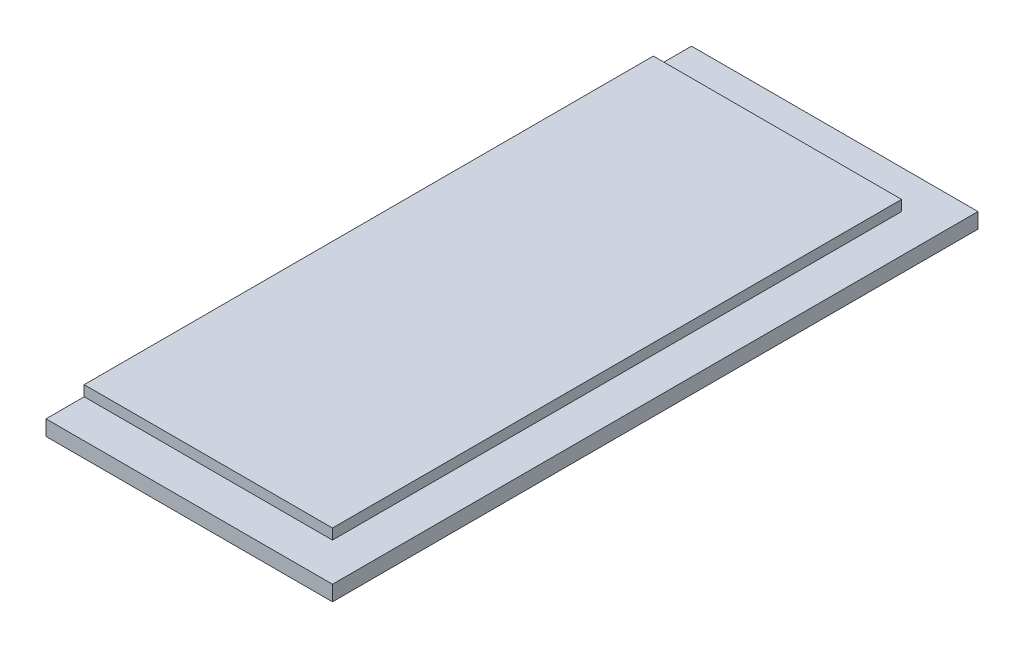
ISO-10303-21;
HEADER;
FILE_DESCRIPTION(('STEP AP214'),'2;1');
FILE_NAME('part.step','',(''),(''),'','','');
FILE_SCHEMA(('AUTOMOTIVE_DESIGN { 1 0 10303 214 1 1 1 1 }'));
ENDSEC;
DATA;
#1=APPLICATION_CONTEXT('core data for automotive mechanical design processes');
#2=APPLICATION_PROTOCOL_DEFINITION('international standard','automotive_design',2000,#1);
#3=PRODUCT_CONTEXT('',#1,'mechanical');
#4=PRODUCT('Part','Part','',(#3));
#5=PRODUCT_RELATED_PRODUCT_CATEGORY('part','',(#4));
#6=PRODUCT_DEFINITION_FORMATION('','',#4);
#7=PRODUCT_DEFINITION_CONTEXT('part definition',#1,'design');
#8=PRODUCT_DEFINITION('design','',#6,#7);
#9=PRODUCT_DEFINITION_SHAPE('','',#8);
#10=(LENGTH_UNIT() NAMED_UNIT(*) SI_UNIT(.MILLI.,.METRE.));
#11=(NAMED_UNIT(*) PLANE_ANGLE_UNIT() SI_UNIT($,.RADIAN.));
#12=(NAMED_UNIT(*) SI_UNIT($,.STERADIAN.) SOLID_ANGLE_UNIT());
#13=UNCERTAINTY_MEASURE_WITH_UNIT(LENGTH_MEASURE(1.E-05),#10,'distance_accuracy_value','');
#14=(GEOMETRIC_REPRESENTATION_CONTEXT(3) GLOBAL_UNCERTAINTY_ASSIGNED_CONTEXT((#13)) GLOBAL_UNIT_ASSIGNED_CONTEXT((#10,
#11,#12)) REPRESENTATION_CONTEXT('',''));
#15=CARTESIAN_POINT('',(0.,0.,0.));
#16=DIRECTION('',(0.,0.,1.));
#17=DIRECTION('',(1.,0.,0.));
#18=AXIS2_PLACEMENT_3D('',#15,#16,#17);
#19=CARTESIAN_POINT('',(15.,3.8,33.8));
#20=DIRECTION('',(-1.,0.,0.));
#21=DIRECTION('',(0.,0.,1.));
#22=AXIS2_PLACEMENT_3D('',#19,#20,#21);
#23=PLANE('',#22);
#24=DIRECTION('',(0.,-1.,0.));
#25=VECTOR('',#24,1.);
#26=CARTESIAN_POINT('',(15.,3.8,33.8));
#27=LINE('',#26,#25);
#28=CARTESIAN_POINT('',(15.,2.7,33.8));
#29=VERTEX_POINT('',#28);
#30=CARTESIAN_POINT('',(15.,1.1,33.8));
#31=VERTEX_POINT('',#30);
#32=EDGE_CURVE('E148',#29,#31,#27,.T.);
#33=ORIENTED_EDGE('',*,*,#32,.T.);
#34=DIRECTION('',(0.,0.,1.));
#35=VECTOR('',#34,1.);
#36=CARTESIAN_POINT('',(15.,1.1,-33.801));
#37=LINE('',#36,#35);
#38=CARTESIAN_POINT('',(15.,1.1,-33.8));
#39=VERTEX_POINT('',#38);
#40=EDGE_CURVE('E214',#39,#31,#37,.T.);
#41=ORIENTED_EDGE('',*,*,#40,.F.);
#42=DIRECTION('',(0.,-1.,0.));
#43=VECTOR('',#42,1.);
#44=CARTESIAN_POINT('',(15.,3.8,-33.8));
#45=LINE('',#44,#43);
#46=CARTESIAN_POINT('',(15.,2.7,-33.8));
#47=VERTEX_POINT('',#46);
#48=EDGE_CURVE('E11',#47,#39,#45,.T.);
#49=ORIENTED_EDGE('',*,*,#48,.F.);
#50=DIRECTION('',(0.,0.,1.));
#51=VECTOR('',#50,1.);
#52=CARTESIAN_POINT('',(15.,2.7,-33.801));
#53=LINE('',#52,#51);
#54=EDGE_CURVE('E146',#47,#29,#53,.T.);
#55=ORIENTED_EDGE('',*,*,#54,.T.);
#56=EDGE_LOOP('',(#33,#41,#49,#55));
#57=FACE_BOUND('',#56,.T.);
#58=ADVANCED_FACE('F31',(#57),#23,.F.);
#59=CARTESIAN_POINT('',(-15.,3.8,-33.8));
#60=DIRECTION('',(0.,0.,1.));
#61=DIRECTION('',(1.,0.,0.));
#62=AXIS2_PLACEMENT_3D('',#59,#60,#61);
#63=PLANE('',#62);
#64=DIRECTION('',(1.,0.,0.));
#65=VECTOR('',#64,1.);
#66=CARTESIAN_POINT('',(15.,1.1,-33.8));
#67=LINE('',#66,#65);
#68=CARTESIAN_POINT('',(-15.,1.1,-33.8));
#69=VERTEX_POINT('',#68);
#70=EDGE_CURVE('E169',#69,#39,#67,.T.);
#71=ORIENTED_EDGE('',*,*,#70,.F.);
#72=DIRECTION('',(0.,-1.,0.));
#73=VECTOR('',#72,1.);
#74=CARTESIAN_POINT('',(-15.,3.8,-33.8));
#75=LINE('',#74,#73);
#76=CARTESIAN_POINT('',(-15.,2.7,-33.8));
#77=VERTEX_POINT('',#76);
#78=EDGE_CURVE('E38',#77,#69,#75,.T.);
#79=ORIENTED_EDGE('',*,*,#78,.F.);
#80=DIRECTION('',(-1.,0.,0.));
#81=VECTOR('',#80,1.);
#82=CARTESIAN_POINT('',(15.,2.7,-33.8));
#83=LINE('',#82,#81);
#84=EDGE_CURVE('E167',#47,#77,#83,.T.);
#85=ORIENTED_EDGE('',*,*,#84,.F.);
#86=ORIENTED_EDGE('',*,*,#48,.T.);
#87=EDGE_LOOP('',(#71,#79,#85,#86));
#88=FACE_BOUND('',#87,.T.);
#89=ADVANCED_FACE('F166',(#88),#63,.F.);
#90=CARTESIAN_POINT('',(-15.,3.8,33.8));
#91=DIRECTION('',(1.,0.,0.));
#92=DIRECTION('',(0.,0.,-1.));
#93=AXIS2_PLACEMENT_3D('',#90,#91,#92);
#94=PLANE('',#93);
#95=ORIENTED_EDGE('',*,*,#78,.T.);
#96=DIRECTION('',(0.,0.,-1.));
#97=VECTOR('',#96,1.);
#98=CARTESIAN_POINT('',(-15.,1.1,-33.8));
#99=LINE('',#98,#97);
#100=CARTESIAN_POINT('',(-15.,1.09999999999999,-29.8));
#101=VERTEX_POINT('',#100);
#102=EDGE_CURVE('E131',#101,#69,#99,.T.);
#103=ORIENTED_EDGE('',*,*,#102,.F.);
#104=DIRECTION('',(0.,1.,0.));
#105=VECTOR('',#104,1.);
#106=CARTESIAN_POINT('',(-15.,0.,-29.8));
#107=LINE('',#106,#105);
#108=CARTESIAN_POINT('',(-15.,0.,-29.8));
#109=VERTEX_POINT('',#108);
#110=EDGE_CURVE('E124',#109,#101,#107,.T.);
#111=ORIENTED_EDGE('',*,*,#110,.F.);
#112=DIRECTION('',(0.,0.,1.));
#113=VECTOR('',#112,1.);
#114=CARTESIAN_POINT('',(-15.,0.,33.8));
#115=LINE('',#114,#113);
#116=CARTESIAN_POINT('',(-15.,0.,29.8));
#117=VERTEX_POINT('',#116);
#118=EDGE_CURVE('E137',#109,#117,#115,.T.);
#119=ORIENTED_EDGE('',*,*,#118,.T.);
#120=DIRECTION('',(0.,-1.,0.));
#121=VECTOR('',#120,1.);
#122=CARTESIAN_POINT('',(-15.,1.1,29.8));
#123=LINE('',#122,#121);
#124=CARTESIAN_POINT('',(-15.,1.1,29.8));
#125=VERTEX_POINT('',#124);
#126=EDGE_CURVE('E190',#125,#117,#123,.T.);
#127=ORIENTED_EDGE('',*,*,#126,.F.);
#128=DIRECTION('',(0.,0.,-1.));
#129=VECTOR('',#128,1.);
#130=CARTESIAN_POINT('',(-15.,1.1,29.8));
#131=LINE('',#130,#129);
#132=CARTESIAN_POINT('',(-15.,1.1,33.8));
#133=VERTEX_POINT('',#132);
#134=EDGE_CURVE('E192',#133,#125,#131,.T.);
#135=ORIENTED_EDGE('',*,*,#134,.F.);
#136=DIRECTION('',(0.,-1.,0.));
#137=VECTOR('',#136,1.);
#138=CARTESIAN_POINT('',(-15.,3.8,33.8));
#139=LINE('',#138,#137);
#140=CARTESIAN_POINT('',(-15.,2.7,33.8));
#141=VERTEX_POINT('',#140);
#142=EDGE_CURVE('E157',#141,#133,#139,.T.);
#143=ORIENTED_EDGE('',*,*,#142,.F.);
#144=DIRECTION('',(0.,0.,1.));
#145=VECTOR('',#144,1.);
#146=CARTESIAN_POINT('',(-15.,2.7,33.8));
#147=LINE('',#146,#145);
#148=CARTESIAN_POINT('',(-15.,2.7,29.8));
#149=VERTEX_POINT('',#148);
#150=EDGE_CURVE('E204',#149,#141,#147,.T.);
#151=ORIENTED_EDGE('',*,*,#150,.F.);
#152=DIRECTION('',(0.,-1.,0.));
#153=VECTOR('',#152,1.);
#154=CARTESIAN_POINT('',(-15.,3.8,29.8));
#155=LINE('',#154,#153);
#156=CARTESIAN_POINT('',(-15.,3.8,29.8));
#157=VERTEX_POINT('',#156);
#158=EDGE_CURVE('E201',#157,#149,#155,.T.);
#159=ORIENTED_EDGE('',*,*,#158,.F.);
#160=DIRECTION('',(0.,0.,1.));
#161=VECTOR('',#160,1.);
#162=CARTESIAN_POINT('',(-15.,3.8,33.8));
#163=LINE('',#162,#161);
#164=CARTESIAN_POINT('',(-15.,3.79999999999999,-29.8));
#165=VERTEX_POINT('',#164);
#166=EDGE_CURVE('E145',#165,#157,#163,.T.);
#167=ORIENTED_EDGE('',*,*,#166,.F.);
#168=DIRECTION('',(0.,1.,0.));
#169=VECTOR('',#168,1.);
#170=CARTESIAN_POINT('',(-15.,3.79999999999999,-29.8));
#171=LINE('',#170,#169);
#172=CARTESIAN_POINT('',(-15.,2.69999999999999,-29.8));
#173=VERTEX_POINT('',#172);
#174=EDGE_CURVE('E181',#173,#165,#171,.T.);
#175=ORIENTED_EDGE('',*,*,#174,.F.);
#176=DIRECTION('',(0.,0.,1.));
#177=VECTOR('',#176,1.);
#178=CARTESIAN_POINT('',(-15.,2.7,-33.8));
#179=LINE('',#178,#177);
#180=EDGE_CURVE('E163',#77,#173,#179,.T.);
#181=ORIENTED_EDGE('',*,*,#180,.F.);
#182=EDGE_LOOP('',(#95,#103,#111,#119,#127,#135,#143,#151,#159,#167,#175,#181));
#183=FACE_BOUND('',#182,.T.);
#184=ADVANCED_FACE('F135',(#183),#94,.F.);
#185=CARTESIAN_POINT('',(-15.,3.8,33.8));
#186=DIRECTION('',(0.,0.,-1.));
#187=DIRECTION('',(-1.,0.,0.));
#188=AXIS2_PLACEMENT_3D('',#185,#186,#187);
#189=PLANE('',#188);
#190=ORIENTED_EDGE('',*,*,#142,.T.);
#191=DIRECTION('',(-1.,0.,0.));
#192=VECTOR('',#191,1.);
#193=CARTESIAN_POINT('',(15.,1.1,33.8));
#194=LINE('',#193,#192);
#195=EDGE_CURVE('E210',#31,#133,#194,.T.);
#196=ORIENTED_EDGE('',*,*,#195,.F.);
#197=ORIENTED_EDGE('',*,*,#32,.F.);
#198=DIRECTION('',(1.,0.,0.));
#199=VECTOR('',#198,1.);
#200=CARTESIAN_POINT('',(15.,2.7,33.8));
#201=LINE('',#200,#199);
#202=EDGE_CURVE('E219',#141,#29,#201,.T.);
#203=ORIENTED_EDGE('',*,*,#202,.F.);
#204=EDGE_LOOP('',(#190,#196,#197,#203));
#205=FACE_BOUND('',#204,.T.);
#206=ADVANCED_FACE('F259',(#205),#189,.F.);
#207=CARTESIAN_POINT('',(15.,3.8,-33.8));
#208=DIRECTION('',(0.,-1.,0.));
#209=DIRECTION('',(0.,0.,-1.));
#210=AXIS2_PLACEMENT_3D('',#207,#208,#209);
#211=PLANE('',#210);
#212=DIRECTION('',(0.,0.,1.));
#213=VECTOR('',#212,1.);
#214=CARTESIAN_POINT('',(11.,3.8,-33.801));
#215=LINE('',#214,#213);
#216=CARTESIAN_POINT('',(11.,3.79999999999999,-29.8));
#217=VERTEX_POINT('',#216);
#218=CARTESIAN_POINT('',(11.,3.8,29.8));
#219=VERTEX_POINT('',#218);
#220=EDGE_CURVE('E220',#217,#219,#215,.T.);
#221=ORIENTED_EDGE('',*,*,#220,.F.);
#222=DIRECTION('',(-1.,0.,0.));
#223=VECTOR('',#222,1.);
#224=CARTESIAN_POINT('',(15.001,3.79999999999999,-29.8));
#225=LINE('',#224,#223);
#226=EDGE_CURVE('E184',#217,#165,#225,.T.);
#227=ORIENTED_EDGE('',*,*,#226,.T.);
#228=ORIENTED_EDGE('',*,*,#166,.T.);
#229=DIRECTION('',(-1.,0.,0.));
#230=VECTOR('',#229,1.);
#231=CARTESIAN_POINT('',(15.001,3.8,29.8));
#232=LINE('',#231,#230);
#233=EDGE_CURVE('E207',#219,#157,#232,.T.);
#234=ORIENTED_EDGE('',*,*,#233,.F.);
#235=EDGE_LOOP('',(#221,#227,#228,#234));
#236=FACE_BOUND('',#235,.T.);
#237=ADVANCED_FACE('F233',(#236),#211,.F.);
#238=CARTESIAN_POINT('',(15.,0.,-33.8));
#239=DIRECTION('',(0.,-1.,0.));
#240=DIRECTION('',(0.,0.,-1.));
#241=AXIS2_PLACEMENT_3D('',#238,#239,#240);
#242=PLANE('',#241);
#243=DIRECTION('',(-1.,0.,0.));
#244=VECTOR('',#243,1.);
#245=CARTESIAN_POINT('',(15.001,0.,-29.8));
#246=LINE('',#245,#244);
#247=CARTESIAN_POINT('',(11.,0.,-29.8));
#248=VERTEX_POINT('',#247);
#249=EDGE_CURVE('E121',#248,#109,#246,.T.);
#250=ORIENTED_EDGE('',*,*,#249,.F.);
#251=DIRECTION('',(0.,0.,1.));
#252=VECTOR('',#251,1.);
#253=CARTESIAN_POINT('',(11.,0.,-33.801));
#254=LINE('',#253,#252);
#255=CARTESIAN_POINT('',(11.,0.,29.8));
#256=VERTEX_POINT('',#255);
#257=EDGE_CURVE('E172',#248,#256,#254,.T.);
#258=ORIENTED_EDGE('',*,*,#257,.T.);
#259=DIRECTION('',(-1.,0.,0.));
#260=VECTOR('',#259,1.);
#261=CARTESIAN_POINT('',(15.001,0.,29.8));
#262=LINE('',#261,#260);
#263=EDGE_CURVE('E144',#256,#117,#262,.T.);
#264=ORIENTED_EDGE('',*,*,#263,.T.);
#265=ORIENTED_EDGE('',*,*,#118,.F.);
#266=EDGE_LOOP('',(#250,#258,#264,#265));
#267=FACE_BOUND('',#266,.T.);
#268=ADVANCED_FACE('F142',(#267),#242,.T.);
#269=CARTESIAN_POINT('',(15.,2.7,-33.801));
#270=DIRECTION('',(0.,-1.,0.));
#271=DIRECTION('',(1.,0.,0.));
#272=AXIS2_PLACEMENT_3D('',#269,#270,#271);
#273=PLANE('',#272);
#274=ORIENTED_EDGE('',*,*,#84,.T.);
#275=ORIENTED_EDGE('',*,*,#180,.T.);
#276=DIRECTION('',(-1.,0.,0.));
#277=VECTOR('',#276,1.);
#278=CARTESIAN_POINT('',(15.001,2.69999999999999,-29.8));
#279=LINE('',#278,#277);
#280=CARTESIAN_POINT('',(11.,2.7,-29.8));
#281=VERTEX_POINT('',#280);
#282=EDGE_CURVE('E183',#281,#173,#279,.T.);
#283=ORIENTED_EDGE('',*,*,#282,.F.);
#284=DIRECTION('',(0.,0.,1.));
#285=VECTOR('',#284,1.);
#286=CARTESIAN_POINT('',(11.,2.7,-33.801));
#287=LINE('',#286,#285);
#288=CARTESIAN_POINT('',(11.,2.7,29.8));
#289=VERTEX_POINT('',#288);
#290=EDGE_CURVE('E151',#281,#289,#287,.T.);
#291=ORIENTED_EDGE('',*,*,#290,.T.);
#292=DIRECTION('',(-1.,0.,0.));
#293=VECTOR('',#292,1.);
#294=CARTESIAN_POINT('',(15.001,2.7,29.8));
#295=LINE('',#294,#293);
#296=EDGE_CURVE('E208',#289,#149,#295,.T.);
#297=ORIENTED_EDGE('',*,*,#296,.T.);
#298=ORIENTED_EDGE('',*,*,#150,.T.);
#299=ORIENTED_EDGE('',*,*,#202,.T.);
#300=ORIENTED_EDGE('',*,*,#54,.F.);
#301=EDGE_LOOP('',(#274,#275,#283,#291,#297,#298,#299,#300));
#302=FACE_BOUND('',#301,.T.);
#303=ADVANCED_FACE('F239',(#302),#273,.F.);
#304=CARTESIAN_POINT('',(11.,3.8,-33.801));
#305=DIRECTION('',(-1.,0.,0.));
#306=DIRECTION('',(0.,0.,1.));
#307=AXIS2_PLACEMENT_3D('',#304,#305,#306);
#308=PLANE('',#307);
#309=ORIENTED_EDGE('',*,*,#290,.F.);
#310=DIRECTION('',(0.,-1.,0.));
#311=VECTOR('',#310,1.);
#312=CARTESIAN_POINT('',(11.,3.79999999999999,-29.8));
#313=LINE('',#312,#311);
#314=EDGE_CURVE('E45',#217,#281,#313,.T.);
#315=ORIENTED_EDGE('',*,*,#314,.F.);
#316=ORIENTED_EDGE('',*,*,#220,.T.);
#317=DIRECTION('',(0.,1.,0.));
#318=VECTOR('',#317,1.);
#319=CARTESIAN_POINT('',(11.,3.8,29.8));
#320=LINE('',#319,#318);
#321=EDGE_CURVE('E197',#289,#219,#320,.T.);
#322=ORIENTED_EDGE('',*,*,#321,.F.);
#323=EDGE_LOOP('',(#309,#315,#316,#322));
#324=FACE_BOUND('',#323,.T.);
#325=ADVANCED_FACE('F226',(#324),#308,.F.);
#326=CARTESIAN_POINT('',(11.,0.,-33.801));
#327=DIRECTION('',(-1.,0.,0.));
#328=DIRECTION('',(0.,0.,1.));
#329=AXIS2_PLACEMENT_3D('',#326,#327,#328);
#330=PLANE('',#329);
#331=ORIENTED_EDGE('',*,*,#257,.F.);
#332=DIRECTION('',(0.,-1.,0.));
#333=VECTOR('',#332,1.);
#334=CARTESIAN_POINT('',(11.,0.,-29.8));
#335=LINE('',#334,#333);
#336=CARTESIAN_POINT('',(11.,1.09999999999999,-29.8));
#337=VERTEX_POINT('',#336);
#338=EDGE_CURVE('E126',#337,#248,#335,.T.);
#339=ORIENTED_EDGE('',*,*,#338,.F.);
#340=DIRECTION('',(0.,0.,1.));
#341=VECTOR('',#340,1.);
#342=CARTESIAN_POINT('',(11.,1.1,-33.801));
#343=LINE('',#342,#341);
#344=CARTESIAN_POINT('',(11.,1.1,29.8));
#345=VERTEX_POINT('',#344);
#346=EDGE_CURVE('E53',#337,#345,#343,.T.);
#347=ORIENTED_EDGE('',*,*,#346,.T.);
#348=DIRECTION('',(0.,1.,0.));
#349=VECTOR('',#348,1.);
#350=CARTESIAN_POINT('',(11.,1.1,29.8));
#351=LINE('',#350,#349);
#352=EDGE_CURVE('E187',#256,#345,#351,.T.);
#353=ORIENTED_EDGE('',*,*,#352,.F.);
#354=EDGE_LOOP('',(#331,#339,#347,#353));
#355=FACE_BOUND('',#354,.T.);
#356=ADVANCED_FACE('F261',(#355),#330,.F.);
#357=CARTESIAN_POINT('',(15.,1.1,-33.801));
#358=DIRECTION('',(0.,1.,0.));
#359=DIRECTION('',(-1.,0.,0.));
#360=AXIS2_PLACEMENT_3D('',#357,#358,#359);
#361=PLANE('',#360);
#362=ORIENTED_EDGE('',*,*,#70,.T.);
#363=ORIENTED_EDGE('',*,*,#40,.T.);
#364=ORIENTED_EDGE('',*,*,#195,.T.);
#365=ORIENTED_EDGE('',*,*,#134,.T.);
#366=DIRECTION('',(-1.,0.,0.));
#367=VECTOR('',#366,1.);
#368=CARTESIAN_POINT('',(15.001,1.1,29.8));
#369=LINE('',#368,#367);
#370=EDGE_CURVE('E195',#345,#125,#369,.T.);
#371=ORIENTED_EDGE('',*,*,#370,.F.);
#372=ORIENTED_EDGE('',*,*,#346,.F.);
#373=DIRECTION('',(-1.,0.,0.));
#374=VECTOR('',#373,1.);
#375=CARTESIAN_POINT('',(15.001,1.09999999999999,-29.8));
#376=LINE('',#375,#374);
#377=EDGE_CURVE('E130',#337,#101,#376,.T.);
#378=ORIENTED_EDGE('',*,*,#377,.T.);
#379=ORIENTED_EDGE('',*,*,#102,.T.);
#380=EDGE_LOOP('',(#362,#363,#364,#365,#371,#372,#378,#379));
#381=FACE_BOUND('',#380,.T.);
#382=ADVANCED_FACE('F174',(#381),#361,.F.);
#383=CARTESIAN_POINT('',(15.001,3.8,29.8));
#384=DIRECTION('',(0.,0.,-1.));
#385=DIRECTION('',(-1.,0.,0.));
#386=AXIS2_PLACEMENT_3D('',#383,#384,#385);
#387=PLANE('',#386);
#388=ORIENTED_EDGE('',*,*,#321,.T.);
#389=ORIENTED_EDGE('',*,*,#233,.T.);
#390=ORIENTED_EDGE('',*,*,#158,.T.);
#391=ORIENTED_EDGE('',*,*,#296,.F.);
#392=EDGE_LOOP('',(#388,#389,#390,#391));
#393=FACE_BOUND('',#392,.T.);
#394=ADVANCED_FACE('F231',(#393),#387,.F.);
#395=CARTESIAN_POINT('',(15.001,1.1,29.8));
#396=DIRECTION('',(0.,0.,-1.));
#397=DIRECTION('',(-1.,0.,0.));
#398=AXIS2_PLACEMENT_3D('',#395,#396,#397);
#399=PLANE('',#398);
#400=ORIENTED_EDGE('',*,*,#352,.T.);
#401=ORIENTED_EDGE('',*,*,#370,.T.);
#402=ORIENTED_EDGE('',*,*,#126,.T.);
#403=ORIENTED_EDGE('',*,*,#263,.F.);
#404=EDGE_LOOP('',(#400,#401,#402,#403));
#405=FACE_BOUND('',#404,.T.);
#406=ADVANCED_FACE('F242',(#405),#399,.F.);
#407=CARTESIAN_POINT('',(15.001,3.79999999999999,-29.8));
#408=DIRECTION('',(0.,0.,1.));
#409=DIRECTION('',(1.,0.,0.));
#410=AXIS2_PLACEMENT_3D('',#407,#408,#409);
#411=PLANE('',#410);
#412=ORIENTED_EDGE('',*,*,#314,.T.);
#413=ORIENTED_EDGE('',*,*,#282,.T.);
#414=ORIENTED_EDGE('',*,*,#174,.T.);
#415=ORIENTED_EDGE('',*,*,#226,.F.);
#416=EDGE_LOOP('',(#412,#413,#414,#415));
#417=FACE_BOUND('',#416,.T.);
#418=ADVANCED_FACE('F240',(#417),#411,.F.);
#419=CARTESIAN_POINT('',(15.001,0.,-29.8));
#420=DIRECTION('',(0.,0.,1.));
#421=DIRECTION('',(1.,0.,0.));
#422=AXIS2_PLACEMENT_3D('',#419,#420,#421);
#423=PLANE('',#422);
#424=ORIENTED_EDGE('',*,*,#338,.T.);
#425=ORIENTED_EDGE('',*,*,#249,.T.);
#426=ORIENTED_EDGE('',*,*,#110,.T.);
#427=ORIENTED_EDGE('',*,*,#377,.F.);
#428=EDGE_LOOP('',(#424,#425,#426,#427));
#429=FACE_BOUND('',#428,.T.);
#430=ADVANCED_FACE('F123',(#429),#423,.F.);
#431=CLOSED_SHELL('',(#58,#89,#184,#206,#237,#268,#303,#325,#356,#382,#394,#406,#418,#430));
#432=MANIFOLD_SOLID_BREP('B2',#431);
#433=ADVANCED_BREP_SHAPE_REPRESENTATION('',(#18,#432),#14);
#434=SHAPE_DEFINITION_REPRESENTATION(#9,#433);
ENDSEC;
END-ISO-10303-21;
